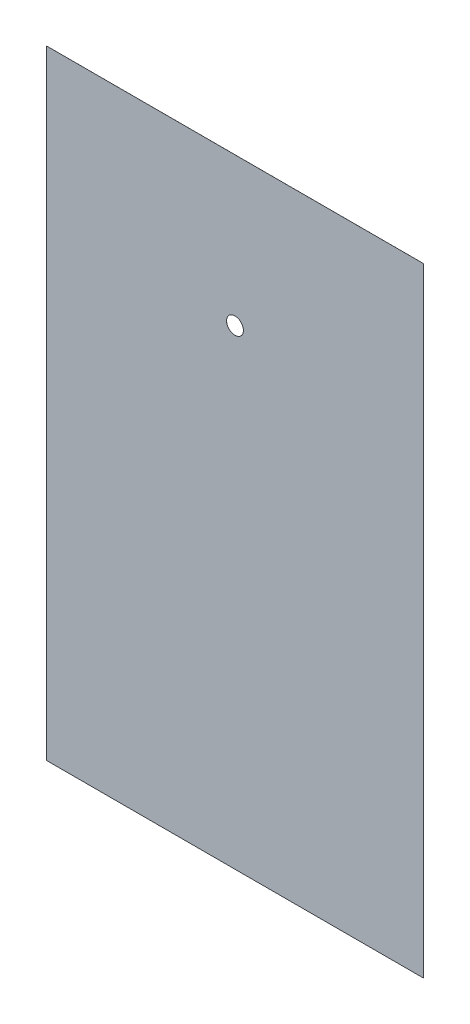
ISO-10303-21;
HEADER;
FILE_DESCRIPTION(('STEP AP214'),'2;1');
FILE_NAME('part.step','',(''),(''),'','','');
FILE_SCHEMA(('AUTOMOTIVE_DESIGN { 1 0 10303 214 1 1 1 1 }'));
ENDSEC;
DATA;
#1=APPLICATION_CONTEXT('core data for automotive mechanical design processes');
#2=APPLICATION_PROTOCOL_DEFINITION('international standard','automotive_design',2000,#1);
#3=PRODUCT_CONTEXT('',#1,'mechanical');
#4=PRODUCT('Part','Part','',(#3));
#5=PRODUCT_RELATED_PRODUCT_CATEGORY('part','',(#4));
#6=PRODUCT_DEFINITION_FORMATION('','',#4);
#7=PRODUCT_DEFINITION_CONTEXT('part definition',#1,'design');
#8=PRODUCT_DEFINITION('design','',#6,#7);
#9=PRODUCT_DEFINITION_SHAPE('','',#8);
#10=(LENGTH_UNIT() NAMED_UNIT(*) SI_UNIT(.MILLI.,.METRE.));
#11=(NAMED_UNIT(*) PLANE_ANGLE_UNIT() SI_UNIT($,.RADIAN.));
#12=(NAMED_UNIT(*) SI_UNIT($,.STERADIAN.) SOLID_ANGLE_UNIT());
#13=UNCERTAINTY_MEASURE_WITH_UNIT(LENGTH_MEASURE(1.E-05),#10,'distance_accuracy_value','');
#14=(GEOMETRIC_REPRESENTATION_CONTEXT(3) GLOBAL_UNCERTAINTY_ASSIGNED_CONTEXT((#13)) GLOBAL_UNIT_ASSIGNED_CONTEXT((#10,
#11,#12)) REPRESENTATION_CONTEXT('',''));
#15=CARTESIAN_POINT('',(0.,0.,0.));
#16=DIRECTION('',(0.,0.,1.));
#17=DIRECTION('',(1.,0.,0.));
#18=AXIS2_PLACEMENT_3D('',#15,#16,#17);
#19=CARTESIAN_POINT('',(0.,0.,0.0254));
#20=DIRECTION('',(0.,0.,1.));
#21=DIRECTION('',(1.,0.,0.));
#22=AXIS2_PLACEMENT_3D('',#19,#20,#21);
#23=PLANE('',#22);
#24=CARTESIAN_POINT('',(0.,0.,0.0254));
#25=DIRECTION('',(0.,0.,1.));
#26=DIRECTION('',(1.,0.,0.));
#27=AXIS2_PLACEMENT_3D('',#24,#25,#26);
#28=CIRCLE('',#27,7.9375);
#29=CARTESIAN_POINT('',(7.9375,0.,0.0254));
#30=VERTEX_POINT('',#29);
#31=EDGE_CURVE('E11',#30,#30,#28,.T.);
#32=ORIENTED_EDGE('',*,*,#31,.F.);
#33=EDGE_LOOP('',(#32));
#34=FACE_BOUND('',#33,.T.);
#35=DIRECTION('',(0.,-1.,0.));
#36=VECTOR('',#35,1.);
#37=CARTESIAN_POINT('',(-177.8,139.7,0.0254));
#38=LINE('',#37,#36);
#39=CARTESIAN_POINT('',(-177.8,139.7,0.0254));
#40=VERTEX_POINT('',#39);
#41=CARTESIAN_POINT('',(-177.8,-444.5,0.0254));
#42=VERTEX_POINT('',#41);
#43=EDGE_CURVE('E76',#40,#42,#38,.T.);
#44=ORIENTED_EDGE('',*,*,#43,.T.);
#45=DIRECTION('',(1.,0.,0.));
#46=VECTOR('',#45,1.);
#47=CARTESIAN_POINT('',(-177.8,-444.5,0.0254));
#48=LINE('',#47,#46);
#49=CARTESIAN_POINT('',(177.8,-444.5,0.0254));
#50=VERTEX_POINT('',#49);
#51=EDGE_CURVE('E84',#42,#50,#48,.T.);
#52=ORIENTED_EDGE('',*,*,#51,.T.);
#53=DIRECTION('',(0.,1.,0.));
#54=VECTOR('',#53,1.);
#55=CARTESIAN_POINT('',(177.8,139.7,0.0254));
#56=LINE('',#55,#54);
#57=CARTESIAN_POINT('',(177.8,139.7,0.0254));
#58=VERTEX_POINT('',#57);
#59=EDGE_CURVE('E90',#50,#58,#56,.T.);
#60=ORIENTED_EDGE('',*,*,#59,.T.);
#61=DIRECTION('',(-1.,0.,0.));
#62=VECTOR('',#61,1.);
#63=CARTESIAN_POINT('',(-177.8,139.7,0.0254));
#64=LINE('',#63,#62);
#65=EDGE_CURVE('E81',#58,#40,#64,.T.);
#66=ORIENTED_EDGE('',*,*,#65,.T.);
#67=EDGE_LOOP('',(#44,#52,#60,#66));
#68=FACE_BOUND('',#67,.T.);
#69=ADVANCED_FACE('F34',(#34,#68),#23,.T.);
#70=CARTESIAN_POINT('',(0.,0.,0.));
#71=DIRECTION('',(0.,0.,1.));
#72=DIRECTION('',(1.,0.,0.));
#73=AXIS2_PLACEMENT_3D('',#70,#71,#72);
#74=PLANE('',#73);
#75=CARTESIAN_POINT('',(0.,0.,0.));
#76=DIRECTION('',(0.,0.,1.));
#77=DIRECTION('',(1.,0.,0.));
#78=AXIS2_PLACEMENT_3D('',#75,#76,#77);
#79=CIRCLE('',#78,7.9375);
#80=CARTESIAN_POINT('',(7.9375,0.,0.));
#81=VERTEX_POINT('',#80);
#82=EDGE_CURVE('E38',#81,#81,#79,.T.);
#83=ORIENTED_EDGE('',*,*,#82,.T.);
#84=EDGE_LOOP('',(#83));
#85=FACE_BOUND('',#84,.T.);
#86=DIRECTION('',(0.,1.,0.));
#87=VECTOR('',#86,1.);
#88=CARTESIAN_POINT('',(-177.8,139.7,0.));
#89=LINE('',#88,#87);
#90=CARTESIAN_POINT('',(-177.8,-444.5,0.));
#91=VERTEX_POINT('',#90);
#92=CARTESIAN_POINT('',(-177.8,139.7,0.));
#93=VERTEX_POINT('',#92);
#94=EDGE_CURVE('E51',#91,#93,#89,.T.);
#95=ORIENTED_EDGE('',*,*,#94,.T.);
#96=DIRECTION('',(1.,0.,0.));
#97=VECTOR('',#96,1.);
#98=CARTESIAN_POINT('',(-177.8,139.7,0.));
#99=LINE('',#98,#97);
#100=CARTESIAN_POINT('',(177.8,139.7,0.));
#101=VERTEX_POINT('',#100);
#102=EDGE_CURVE('E110',#93,#101,#99,.T.);
#103=ORIENTED_EDGE('',*,*,#102,.T.);
#104=DIRECTION('',(0.,-1.,0.));
#105=VECTOR('',#104,1.);
#106=CARTESIAN_POINT('',(177.8,139.7,0.));
#107=LINE('',#106,#105);
#108=CARTESIAN_POINT('',(177.8,-444.5,0.));
#109=VERTEX_POINT('',#108);
#110=EDGE_CURVE('E101',#101,#109,#107,.T.);
#111=ORIENTED_EDGE('',*,*,#110,.T.);
#112=DIRECTION('',(-1.,0.,0.));
#113=VECTOR('',#112,1.);
#114=CARTESIAN_POINT('',(-177.8,-444.5,0.));
#115=LINE('',#114,#113);
#116=EDGE_CURVE('E111',#109,#91,#115,.T.);
#117=ORIENTED_EDGE('',*,*,#116,.T.);
#118=EDGE_LOOP('',(#95,#103,#111,#117));
#119=FACE_BOUND('',#118,.T.);
#120=ADVANCED_FACE('F36',(#85,#119),#74,.F.);
#121=CARTESIAN_POINT('',(0.,0.,0.0254));
#122=DIRECTION('',(0.,0.,-1.));
#123=DIRECTION('',(-1.,0.,0.));
#124=AXIS2_PLACEMENT_3D('',#121,#122,#123);
#125=CYLINDRICAL_SURFACE('',#124,7.9375);
#126=ORIENTED_EDGE('',*,*,#31,.T.);
#127=EDGE_LOOP('',(#126));
#128=FACE_BOUND('',#127,.T.);
#129=ORIENTED_EDGE('',*,*,#82,.F.);
#130=EDGE_LOOP('',(#129));
#131=FACE_BOUND('',#130,.T.);
#132=ADVANCED_FACE('F118',(#128,#131),#125,.F.);
#133=CARTESIAN_POINT('',(-177.8,-444.5,-683.915930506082));
#134=DIRECTION('',(0.,-1.,0.));
#135=DIRECTION('',(0.,0.,-1.));
#136=AXIS2_PLACEMENT_3D('',#133,#134,#135);
#137=PLANE('',#136);
#138=ORIENTED_EDGE('',*,*,#116,.F.);
#139=DIRECTION('',(0.,0.,1.));
#140=VECTOR('',#139,1.);
#141=CARTESIAN_POINT('',(177.8,-444.5,-683.915930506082));
#142=LINE('',#141,#140);
#143=EDGE_CURVE('E80',#109,#50,#142,.T.);
#144=ORIENTED_EDGE('',*,*,#143,.T.);
#145=ORIENTED_EDGE('',*,*,#51,.F.);
#146=DIRECTION('',(0.,0.,1.));
#147=VECTOR('',#146,1.);
#148=CARTESIAN_POINT('',(-177.8,-444.5,-683.915930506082));
#149=LINE('',#148,#147);
#150=EDGE_CURVE('E71',#91,#42,#149,.T.);
#151=ORIENTED_EDGE('',*,*,#150,.F.);
#152=EDGE_LOOP('',(#138,#144,#145,#151));
#153=FACE_BOUND('',#152,.T.);
#154=ADVANCED_FACE('F85',(#153),#137,.T.);
#155=CARTESIAN_POINT('',(177.8,139.7,-683.915930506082));
#156=DIRECTION('',(1.,0.,0.));
#157=DIRECTION('',(0.,1.,0.));
#158=AXIS2_PLACEMENT_3D('',#155,#156,#157);
#159=PLANE('',#158);
#160=ORIENTED_EDGE('',*,*,#110,.F.);
#161=DIRECTION('',(0.,0.,1.));
#162=VECTOR('',#161,1.);
#163=CARTESIAN_POINT('',(177.8,139.7,-683.915930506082));
#164=LINE('',#163,#162);
#165=EDGE_CURVE('E102',#101,#58,#164,.T.);
#166=ORIENTED_EDGE('',*,*,#165,.T.);
#167=ORIENTED_EDGE('',*,*,#59,.F.);
#168=ORIENTED_EDGE('',*,*,#143,.F.);
#169=EDGE_LOOP('',(#160,#166,#167,#168));
#170=FACE_BOUND('',#169,.T.);
#171=ADVANCED_FACE('F107',(#170),#159,.T.);
#172=CARTESIAN_POINT('',(-177.8,139.7,-683.915930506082));
#173=DIRECTION('',(0.,1.,0.));
#174=DIRECTION('',(-1.,0.,0.));
#175=AXIS2_PLACEMENT_3D('',#172,#173,#174);
#176=PLANE('',#175);
#177=ORIENTED_EDGE('',*,*,#102,.F.);
#178=DIRECTION('',(0.,0.,1.));
#179=VECTOR('',#178,1.);
#180=CARTESIAN_POINT('',(-177.8,139.7,-683.915930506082));
#181=LINE('',#180,#179);
#182=EDGE_CURVE('E99',#93,#40,#181,.T.);
#183=ORIENTED_EDGE('',*,*,#182,.T.);
#184=ORIENTED_EDGE('',*,*,#65,.F.);
#185=ORIENTED_EDGE('',*,*,#165,.F.);
#186=EDGE_LOOP('',(#177,#183,#184,#185));
#187=FACE_BOUND('',#186,.T.);
#188=ADVANCED_FACE('F109',(#187),#176,.T.);
#189=CARTESIAN_POINT('',(-177.8,139.7,-683.915930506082));
#190=DIRECTION('',(-1.,0.,0.));
#191=DIRECTION('',(0.,-1.,0.));
#192=AXIS2_PLACEMENT_3D('',#189,#190,#191);
#193=PLANE('',#192);
#194=ORIENTED_EDGE('',*,*,#94,.F.);
#195=ORIENTED_EDGE('',*,*,#150,.T.);
#196=ORIENTED_EDGE('',*,*,#43,.F.);
#197=ORIENTED_EDGE('',*,*,#182,.F.);
#198=EDGE_LOOP('',(#194,#195,#196,#197));
#199=FACE_BOUND('',#198,.T.);
#200=ADVANCED_FACE('F73',(#199),#193,.T.);
#201=CLOSED_SHELL('',(#69,#120,#132,#154,#171,#188,#200));
#202=MANIFOLD_SOLID_BREP('B2',#201);
#203=ADVANCED_BREP_SHAPE_REPRESENTATION('',(#18,#202),#14);
#204=SHAPE_DEFINITION_REPRESENTATION(#9,#203);
ENDSEC;
END-ISO-10303-21;
